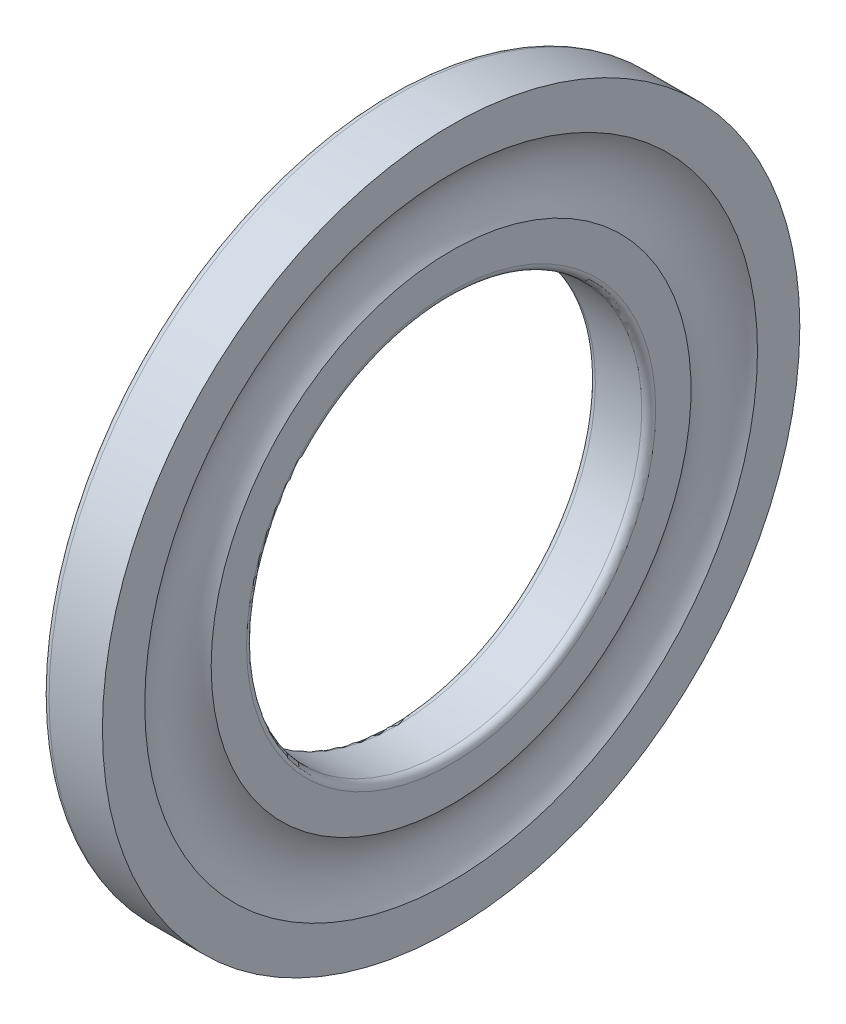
ISO-10303-21;
HEADER;
FILE_DESCRIPTION(('STEP AP214'),'2;1');
FILE_NAME('part.step','',(''),(''),'','','');
FILE_SCHEMA(('AUTOMOTIVE_DESIGN { 1 0 10303 214 1 1 1 1 }'));
ENDSEC;
DATA;
#1=APPLICATION_CONTEXT('core data for automotive mechanical design processes');
#2=APPLICATION_PROTOCOL_DEFINITION('international standard','automotive_design',2000,#1);
#3=PRODUCT_CONTEXT('',#1,'mechanical');
#4=PRODUCT('Part','Part','',(#3));
#5=PRODUCT_RELATED_PRODUCT_CATEGORY('part','',(#4));
#6=PRODUCT_DEFINITION_FORMATION('','',#4);
#7=PRODUCT_DEFINITION_CONTEXT('part definition',#1,'design');
#8=PRODUCT_DEFINITION('design','',#6,#7);
#9=PRODUCT_DEFINITION_SHAPE('','',#8);
#10=(LENGTH_UNIT() NAMED_UNIT(*) SI_UNIT(.MILLI.,.METRE.));
#11=(NAMED_UNIT(*) PLANE_ANGLE_UNIT() SI_UNIT($,.RADIAN.));
#12=(NAMED_UNIT(*) SI_UNIT($,.STERADIAN.) SOLID_ANGLE_UNIT());
#13=UNCERTAINTY_MEASURE_WITH_UNIT(LENGTH_MEASURE(1.E-05),#10,'distance_accuracy_value','');
#14=(GEOMETRIC_REPRESENTATION_CONTEXT(3) GLOBAL_UNCERTAINTY_ASSIGNED_CONTEXT((#13)) GLOBAL_UNIT_ASSIGNED_CONTEXT((#10,
#11,#12)) REPRESENTATION_CONTEXT('',''));
#15=CARTESIAN_POINT('',(0.,0.,0.));
#16=DIRECTION('',(0.,0.,1.));
#17=DIRECTION('',(1.,0.,0.));
#18=AXIS2_PLACEMENT_3D('',#15,#16,#17);
#19=CARTESIAN_POINT('',(0.,-14.9730722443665,-14.7));
#20=DIRECTION('',(-1.,0.,0.));
#21=DIRECTION('',(0.,0.,1.));
#22=AXIS2_PLACEMENT_3D('',#19,#20,#21);
#23=PLANE('',#22);
#24=CARTESIAN_POINT('',(0.,0.,0.));
#25=DIRECTION('',(-1.,0.,0.));
#26=DIRECTION('',(0.,0.,-1.));
#27=AXIS2_PLACEMENT_3D('',#24,#25,#26);
#28=CIRCLE('',#27,14.7);
#29=CARTESIAN_POINT('',(0.,0.,-14.7));
#30=VERTEX_POINT('',#29);
#31=EDGE_CURVE('E47',#30,#30,#28,.F.);
#32=ORIENTED_EDGE('',*,*,#31,.F.);
#33=EDGE_LOOP('',(#32));
#34=FACE_BOUND('',#33,.T.);
#35=CARTESIAN_POINT('',(0.,0.,0.));
#36=DIRECTION('',(1.,0.,0.));
#37=DIRECTION('',(0.,0.,1.));
#38=AXIS2_PLACEMENT_3D('',#35,#36,#37);
#39=CIRCLE('',#38,8.80000001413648);
#40=CARTESIAN_POINT('',(0.,0.,8.80000001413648));
#41=VERTEX_POINT('',#40);
#42=EDGE_CURVE('E44',#41,#41,#39,.T.);
#43=ORIENTED_EDGE('',*,*,#42,.T.);
#44=EDGE_LOOP('',(#43));
#45=FACE_BOUND('',#44,.T.);
#46=ADVANCED_FACE('F15',(#34,#45),#23,.T.);
#47=CARTESIAN_POINT('',(2.5952,-10.6034214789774,10.3214));
#48=DIRECTION('',(1.,0.,0.));
#49=DIRECTION('',(0.,0.,-1.));
#50=AXIS2_PLACEMENT_3D('',#47,#48,#49);
#51=PLANE('',#50);
#52=CARTESIAN_POINT('',(2.5952,0.,0.));
#53=DIRECTION('',(1.,0.,0.));
#54=DIRECTION('',(0.,-1.1684331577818E-09,1.));
#55=AXIS2_PLACEMENT_3D('',#52,#53,#54);
#56=CIRCLE('',#55,10.3214);
#57=CARTESIAN_POINT('',(2.5952,-1.20598659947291E-08,10.3214));
#58=VERTEX_POINT('',#57);
#59=EDGE_CURVE('E41',#58,#58,#56,.T.);
#60=ORIENTED_EDGE('',*,*,#59,.T.);
#61=EDGE_LOOP('',(#60));
#62=FACE_BOUND('',#61,.T.);
#63=CARTESIAN_POINT('',(2.5952,0.,0.));
#64=DIRECTION('',(-1.,0.,0.));
#65=DIRECTION('',(0.,0.,-1.));
#66=AXIS2_PLACEMENT_3D('',#63,#64,#65);
#67=CIRCLE('',#66,8.79999999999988);
#68=CARTESIAN_POINT('',(2.5952,0.,-8.79999999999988));
#69=VERTEX_POINT('',#68);
#70=EDGE_CURVE('E38',#69,#69,#67,.F.);
#71=ORIENTED_EDGE('',*,*,#70,.F.);
#72=EDGE_LOOP('',(#71));
#73=FACE_BOUND('',#72,.T.);
#74=ADVANCED_FACE('F55',(#62,#73),#51,.T.);
#75=CARTESIAN_POINT('',(2.5952,-15.2786451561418,15.));
#76=DIRECTION('',(1.,0.,0.));
#77=DIRECTION('',(0.,0.,-1.));
#78=AXIS2_PLACEMENT_3D('',#75,#76,#77);
#79=PLANE('',#78);
#80=CARTESIAN_POINT('',(2.5952,0.,0.));
#81=DIRECTION('',(1.,0.,0.));
#82=DIRECTION('',(0.,0.,1.));
#83=AXIS2_PLACEMENT_3D('',#80,#81,#82);
#84=CIRCLE('',#83,15.);
#85=CARTESIAN_POINT('',(2.5952,0.,15.));
#86=VERTEX_POINT('',#85);
#87=EDGE_CURVE('E35',#86,#86,#84,.T.);
#88=ORIENTED_EDGE('',*,*,#87,.T.);
#89=EDGE_LOOP('',(#88));
#90=FACE_BOUND('',#89,.T.);
#91=CARTESIAN_POINT('',(2.5952,0.,0.));
#92=DIRECTION('',(-1.,0.,0.));
#93=DIRECTION('',(0.,0.,-1.));
#94=AXIS2_PLACEMENT_3D('',#91,#92,#93);
#95=CIRCLE('',#94,13.1786);
#96=CARTESIAN_POINT('',(2.5952,0.,-13.1786));
#97=VERTEX_POINT('',#96);
#98=EDGE_CURVE('E30',#97,#97,#95,.F.);
#99=ORIENTED_EDGE('',*,*,#98,.F.);
#100=EDGE_LOOP('',(#99));
#101=FACE_BOUND('',#100,.T.);
#102=ADVANCED_FACE('F62',(#90,#101),#79,.T.);
#103=CARTESIAN_POINT('',(0.299999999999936,0.,0.));
#104=DIRECTION('',(1.,0.,0.));
#105=DIRECTION('',(0.,0.,1.));
#106=AXIS2_PLACEMENT_3D('',#103,#104,#105);
#107=TOROIDAL_SURFACE('',#106,8.8,0.299999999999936);
#108=CARTESIAN_POINT('',(0.3,0.,0.));
#109=DIRECTION('',(1.,0.,0.));
#110=DIRECTION('',(0.,0.,1.));
#111=AXIS2_PLACEMENT_3D('',#108,#109,#110);
#112=CIRCLE('',#111,8.50000000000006);
#113=CARTESIAN_POINT('',(0.3,0.,8.50000000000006));
#114=VERTEX_POINT('',#113);
#115=EDGE_CURVE('E26',#114,#114,#112,.T.);
#116=ORIENTED_EDGE('',*,*,#115,.T.);
#117=EDGE_LOOP('',(#116));
#118=FACE_BOUND('',#117,.T.);
#119=ORIENTED_EDGE('',*,*,#42,.F.);
#120=EDGE_LOOP('',(#119));
#121=FACE_BOUND('',#120,.T.);
#122=ADVANCED_FACE('F59',(#118,#121),#107,.T.);
#123=CARTESIAN_POINT('',(2.5952,0.,0.));
#124=DIRECTION('',(1.,0.,0.));
#125=DIRECTION('',(0.,0.,1.));
#126=AXIS2_PLACEMENT_3D('',#123,#124,#125);
#127=CYLINDRICAL_SURFACE('',#126,8.5);
#128=CARTESIAN_POINT('',(2.2952,0.,0.));
#129=DIRECTION('',(1.,0.,0.));
#130=DIRECTION('',(0.,0.,1.));
#131=AXIS2_PLACEMENT_3D('',#128,#129,#130);
#132=CIRCLE('',#131,8.5);
#133=CARTESIAN_POINT('',(2.2952,0.,8.5));
#134=VERTEX_POINT('',#133);
#135=EDGE_CURVE('E22',#134,#134,#132,.T.);
#136=ORIENTED_EDGE('',*,*,#135,.T.);
#137=EDGE_LOOP('',(#136));
#138=FACE_BOUND('',#137,.T.);
#139=ORIENTED_EDGE('',*,*,#115,.F.);
#140=EDGE_LOOP('',(#139));
#141=FACE_BOUND('',#140,.T.);
#142=ADVANCED_FACE('F61',(#138,#141),#127,.F.);
#143=CARTESIAN_POINT('',(2.29520000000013,0.,0.));
#144=DIRECTION('',(1.,0.,0.));
#145=DIRECTION('',(0.,0.,1.));
#146=AXIS2_PLACEMENT_3D('',#143,#144,#145);
#147=TOROIDAL_SURFACE('',#146,8.79999999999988,0.299999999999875);
#148=ORIENTED_EDGE('',*,*,#70,.T.);
#149=EDGE_LOOP('',(#148));
#150=FACE_BOUND('',#149,.T.);
#151=ORIENTED_EDGE('',*,*,#135,.F.);
#152=EDGE_LOOP('',(#151));
#153=FACE_BOUND('',#152,.T.);
#154=ADVANCED_FACE('F70',(#150,#153),#147,.T.);
#155=CARTESIAN_POINT('',(4.5,0.,0.));
#156=DIRECTION('',(1.,0.,0.));
#157=DIRECTION('',(0.,0.,1.));
#158=AXIS2_PLACEMENT_3D('',#155,#156,#157);
#159=TOROIDAL_SURFACE('',#158,11.75,2.381);
#160=ORIENTED_EDGE('',*,*,#59,.F.);
#161=EDGE_LOOP('',(#160));
#162=FACE_BOUND('',#161,.T.);
#163=ORIENTED_EDGE('',*,*,#98,.T.);
#164=EDGE_LOOP('',(#163));
#165=FACE_BOUND('',#164,.T.);
#166=ADVANCED_FACE('F78',(#162,#165),#159,.F.);
#167=CARTESIAN_POINT('',(2.5952,0.,0.));
#168=DIRECTION('',(1.,0.,0.));
#169=DIRECTION('',(0.,0.,1.));
#170=AXIS2_PLACEMENT_3D('',#167,#168,#169);
#171=CYLINDRICAL_SURFACE('',#170,15.);
#172=CARTESIAN_POINT('',(0.299999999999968,0.,0.));
#173=DIRECTION('',(1.,0.,0.));
#174=DIRECTION('',(0.,0.,1.));
#175=AXIS2_PLACEMENT_3D('',#172,#173,#174);
#176=CIRCLE('',#175,15.);
#177=CARTESIAN_POINT('',(0.299999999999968,0.,15.));
#178=VERTEX_POINT('',#177);
#179=EDGE_CURVE('E10',#178,#178,#176,.T.);
#180=ORIENTED_EDGE('',*,*,#179,.T.);
#181=EDGE_LOOP('',(#180));
#182=FACE_BOUND('',#181,.T.);
#183=ORIENTED_EDGE('',*,*,#87,.F.);
#184=EDGE_LOOP('',(#183));
#185=FACE_BOUND('',#184,.T.);
#186=ADVANCED_FACE('F81',(#182,#185),#171,.T.);
#187=CARTESIAN_POINT('',(0.299999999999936,0.,0.));
#188=DIRECTION('',(1.,0.,0.));
#189=DIRECTION('',(0.,1.16855826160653E-09,1.));
#190=AXIS2_PLACEMENT_3D('',#187,#188,#189);
#191=TOROIDAL_SURFACE('',#190,14.7,0.299999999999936);
#192=ORIENTED_EDGE('',*,*,#31,.T.);
#193=EDGE_LOOP('',(#192));
#194=FACE_BOUND('',#193,.T.);
#195=ORIENTED_EDGE('',*,*,#179,.F.);
#196=EDGE_LOOP('',(#195));
#197=FACE_BOUND('',#196,.T.);
#198=ADVANCED_FACE('F17',(#194,#197),#191,.T.);
#199=CLOSED_SHELL('',(#46,#74,#102,#122,#142,#154,#166,#186,#198));
#200=MANIFOLD_SOLID_BREP('B1',#199);
#201=ADVANCED_BREP_SHAPE_REPRESENTATION('',(#18,#200),#14);
#202=SHAPE_DEFINITION_REPRESENTATION(#9,#201);
ENDSEC;
END-ISO-10303-21;
